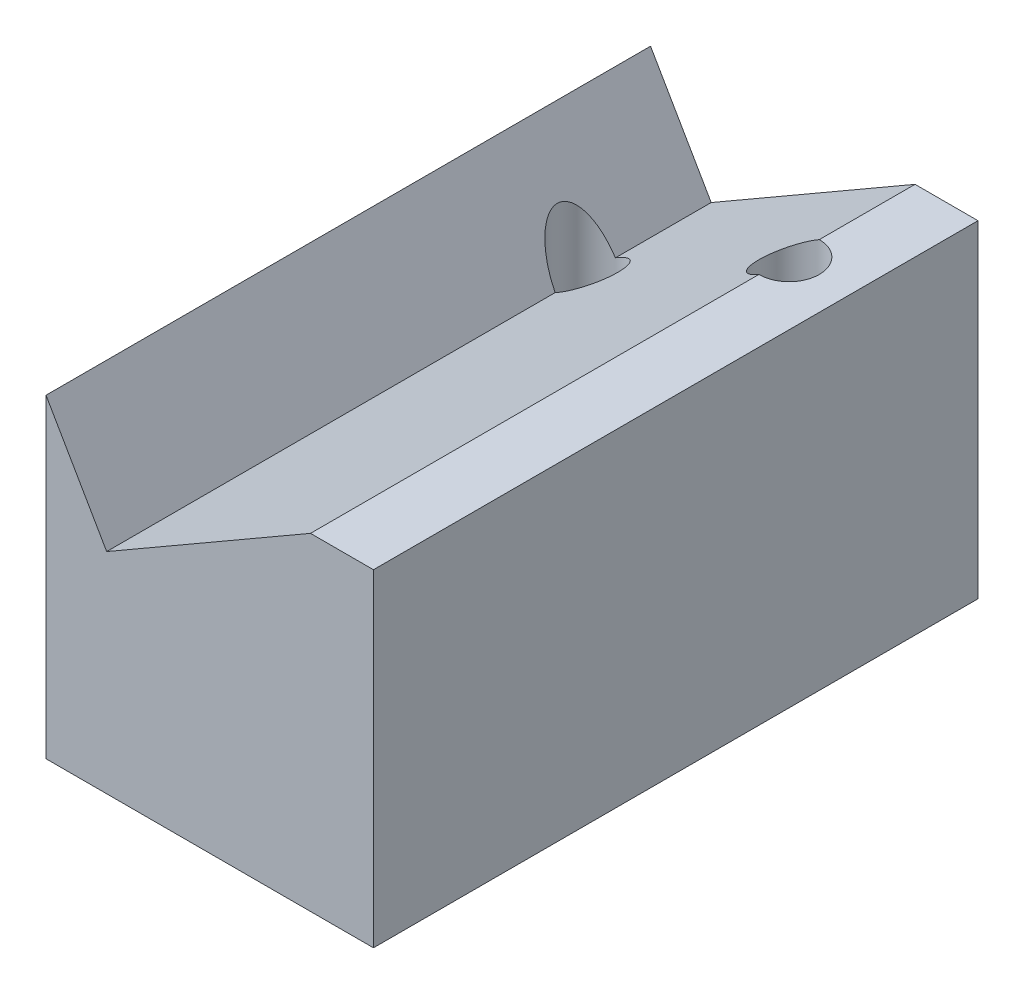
from build123d import *

# Parameters (mm, degrees)
EXTRUSION1_DEPTH      = 24
TROU_TARAUD_M3X0_51_D = 2.4


with BuildPart() as part:
    # Esquisse1 → Extrusion1 (new body)
    with BuildSketch(Plane.XY):
        Polygon((6.5, 13), (4, 13), (-4.091506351, 8.32836663), (-6.5, 12.5), (-6.5, 0), (6.5, 0), align=None)
    extrude(amount=EXTRUSION1_DEPTH)

    # Trou taraud_ M3x0.51 (through all)
    with Locations(Plane.XZ):
        with Locations((-4, 5), (4, 5)):
            Hole(TROU_TARAUD_M3X0_51_D / 2)


solid = part.part
